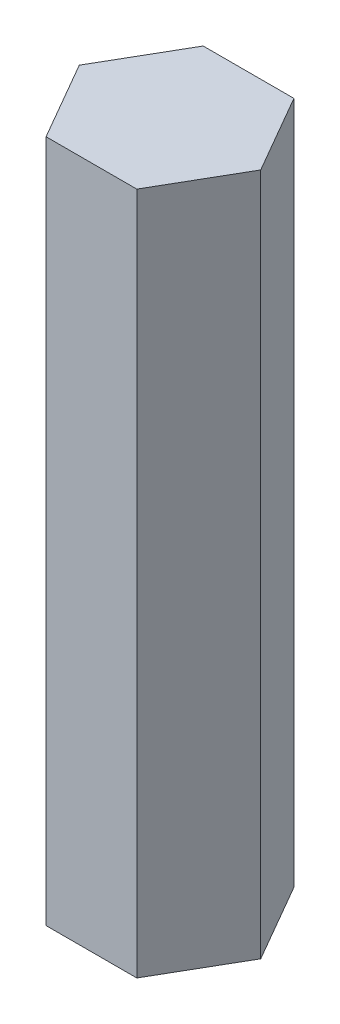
ISO-10303-21;
HEADER;
FILE_DESCRIPTION(('STEP AP214'),'2;1');
FILE_NAME('part.step','',(''),(''),'','','');
FILE_SCHEMA(('AUTOMOTIVE_DESIGN { 1 0 10303 214 1 1 1 1 }'));
ENDSEC;
DATA;
#1=APPLICATION_CONTEXT('core data for automotive mechanical design processes');
#2=APPLICATION_PROTOCOL_DEFINITION('international standard','automotive_design',2000,#1);
#3=PRODUCT_CONTEXT('',#1,'mechanical');
#4=PRODUCT('Part','Part','',(#3));
#5=PRODUCT_RELATED_PRODUCT_CATEGORY('part','',(#4));
#6=PRODUCT_DEFINITION_FORMATION('','',#4);
#7=PRODUCT_DEFINITION_CONTEXT('part definition',#1,'design');
#8=PRODUCT_DEFINITION('design','',#6,#7);
#9=PRODUCT_DEFINITION_SHAPE('','',#8);
#10=(LENGTH_UNIT() NAMED_UNIT(*) SI_UNIT(.MILLI.,.METRE.));
#11=(NAMED_UNIT(*) PLANE_ANGLE_UNIT() SI_UNIT($,.RADIAN.));
#12=(NAMED_UNIT(*) SI_UNIT($,.STERADIAN.) SOLID_ANGLE_UNIT());
#13=UNCERTAINTY_MEASURE_WITH_UNIT(LENGTH_MEASURE(1.E-05),#10,'distance_accuracy_value','');
#14=(GEOMETRIC_REPRESENTATION_CONTEXT(3) GLOBAL_UNCERTAINTY_ASSIGNED_CONTEXT((#13)) GLOBAL_UNIT_ASSIGNED_CONTEXT((#10,
#11,#12)) REPRESENTATION_CONTEXT('',''));
#15=CARTESIAN_POINT('',(0.,0.,0.));
#16=DIRECTION('',(0.,0.,1.));
#17=DIRECTION('',(1.,0.,0.));
#18=AXIS2_PLACEMENT_3D('',#15,#16,#17);
#19=CARTESIAN_POINT('',(-1.65994818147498,25.,2.874961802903));
#20=DIRECTION('',(2.30114762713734E-05,0.,-0.999999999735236));
#21=DIRECTION('',(-0.999999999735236,0.,-2.30114762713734E-05));
#22=AXIS2_PLACEMENT_3D('',#19,#20,#21);
#23=PLANE('',#22);
#24=DIRECTION('',(0.999999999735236,0.,2.30114762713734E-05));
#25=VECTOR('',#24,1.);
#26=CARTESIAN_POINT('',(-1.65994818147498,0.,2.874961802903));
#27=LINE('',#26,#25);
#28=CARTESIAN_POINT('',(-1.65994818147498,0.,2.874961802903));
#29=VERTEX_POINT('',#28);
#30=CARTESIAN_POINT('',(1.65981586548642,0.,2.87503819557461));
#31=VERTEX_POINT('',#30);
#32=EDGE_CURVE('E119',#29,#31,#27,.T.);
#33=ORIENTED_EDGE('',*,*,#32,.T.);
#34=DIRECTION('',(0.,-1.,0.));
#35=VECTOR('',#34,1.);
#36=CARTESIAN_POINT('',(1.65981586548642,25.,2.87503819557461));
#37=LINE('',#36,#35);
#38=CARTESIAN_POINT('',(1.65981586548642,25.,2.87503819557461));
#39=VERTEX_POINT('',#38);
#40=EDGE_CURVE('E11',#39,#31,#37,.T.);
#41=ORIENTED_EDGE('',*,*,#40,.F.);
#42=DIRECTION('',(0.999999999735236,0.,2.30114762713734E-05));
#43=VECTOR('',#42,1.);
#44=CARTESIAN_POINT('',(-1.65994818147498,25.,2.874961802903));
#45=LINE('',#44,#43);
#46=CARTESIAN_POINT('',(-1.65994818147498,25.,2.874961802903));
#47=VERTEX_POINT('',#46);
#48=EDGE_CURVE('E129',#47,#39,#45,.T.);
#49=ORIENTED_EDGE('',*,*,#48,.F.);
#50=DIRECTION('',(0.,-1.,0.));
#51=VECTOR('',#50,1.);
#52=CARTESIAN_POINT('',(-1.65994818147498,25.,2.874961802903));
#53=LINE('',#52,#51);
#54=EDGE_CURVE('E115',#47,#29,#53,.T.);
#55=ORIENTED_EDGE('',*,*,#54,.T.);
#56=EDGE_LOOP('',(#33,#41,#49,#55));
#57=FACE_BOUND('',#56,.T.);
#58=ADVANCED_FACE('F35',(#57),#23,.F.);
#59=CARTESIAN_POINT('',(1.65981586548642,25.,2.87503819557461));
#60=DIRECTION('',(-0.866013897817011,0.,-0.500019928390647));
#61=DIRECTION('',(-0.500019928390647,0.,0.866013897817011));
#62=AXIS2_PLACEMENT_3D('',#59,#60,#61);
#63=PLANE('',#62);
#64=DIRECTION('',(0.500019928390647,0.,-0.866013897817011));
#65=VECTOR('',#64,1.);
#66=CARTESIAN_POINT('',(1.65981586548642,0.,2.87503819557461));
#67=LINE('',#66,#65);
#68=CARTESIAN_POINT('',(3.31976404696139,0.,7.63926716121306E-05));
#69=VERTEX_POINT('',#68);
#70=EDGE_CURVE('E122',#31,#69,#67,.T.);
#71=ORIENTED_EDGE('',*,*,#70,.T.);
#72=DIRECTION('',(0.,-1.,0.));
#73=VECTOR('',#72,1.);
#74=CARTESIAN_POINT('',(3.31976404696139,25.,7.63926716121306E-05));
#75=LINE('',#74,#73);
#76=CARTESIAN_POINT('',(3.31976404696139,25.,7.63926716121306E-05));
#77=VERTEX_POINT('',#76);
#78=EDGE_CURVE('E43',#77,#69,#75,.T.);
#79=ORIENTED_EDGE('',*,*,#78,.F.);
#80=DIRECTION('',(0.500019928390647,0.,-0.866013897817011));
#81=VECTOR('',#80,1.);
#82=CARTESIAN_POINT('',(1.65981586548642,25.,2.87503819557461));
#83=LINE('',#82,#81);
#84=EDGE_CURVE('E88',#39,#77,#83,.T.);
#85=ORIENTED_EDGE('',*,*,#84,.F.);
#86=ORIENTED_EDGE('',*,*,#40,.T.);
#87=EDGE_LOOP('',(#71,#79,#85,#86));
#88=FACE_BOUND('',#87,.T.);
#89=ADVANCED_FACE('F153',(#88),#63,.F.);
#90=CARTESIAN_POINT('',(3.31976404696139,25.,7.63926716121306E-05));
#91=DIRECTION('',(-0.866036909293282,0.,0.499980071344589));
#92=DIRECTION('',(0.499980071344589,0.,0.866036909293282));
#93=AXIS2_PLACEMENT_3D('',#90,#91,#92);
#94=PLANE('',#93);
#95=DIRECTION('',(-0.499980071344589,0.,-0.866036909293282));
#96=VECTOR('',#95,1.);
#97=CARTESIAN_POINT('',(3.31976404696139,0.,7.63926716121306E-05));
#98=LINE('',#97,#96);
#99=CARTESIAN_POINT('',(1.65994818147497,0.,-2.874961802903));
#100=VERTEX_POINT('',#99);
#101=EDGE_CURVE('E124',#69,#100,#98,.T.);
#102=ORIENTED_EDGE('',*,*,#101,.T.);
#103=DIRECTION('',(0.,-1.,0.));
#104=VECTOR('',#103,1.);
#105=CARTESIAN_POINT('',(1.65994818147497,25.,-2.874961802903));
#106=LINE('',#105,#104);
#107=CARTESIAN_POINT('',(1.65994818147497,25.,-2.874961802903));
#108=VERTEX_POINT('',#107);
#109=EDGE_CURVE('E110',#108,#100,#106,.T.);
#110=ORIENTED_EDGE('',*,*,#109,.F.);
#111=DIRECTION('',(-0.499980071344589,0.,-0.866036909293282));
#112=VECTOR('',#111,1.);
#113=CARTESIAN_POINT('',(3.31976404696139,25.,7.63926716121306E-05));
#114=LINE('',#113,#112);
#115=EDGE_CURVE('E101',#77,#108,#114,.T.);
#116=ORIENTED_EDGE('',*,*,#115,.F.);
#117=ORIENTED_EDGE('',*,*,#78,.T.);
#118=EDGE_LOOP('',(#102,#110,#116,#117));
#119=FACE_BOUND('',#118,.T.);
#120=ADVANCED_FACE('F135',(#119),#94,.F.);
#121=CARTESIAN_POINT('',(1.65994818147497,25.,-2.874961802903));
#122=DIRECTION('',(-2.30114762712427E-05,0.,0.999999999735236));
#123=DIRECTION('',(0.999999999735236,0.,2.30114762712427E-05));
#124=AXIS2_PLACEMENT_3D('',#121,#122,#123);
#125=PLANE('',#124);
#126=DIRECTION('',(-0.999999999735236,0.,-2.30114762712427E-05));
#127=VECTOR('',#126,1.);
#128=CARTESIAN_POINT('',(1.65994818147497,0.,-2.874961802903));
#129=LINE('',#128,#127);
#130=CARTESIAN_POINT('',(-1.65981586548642,0.,-2.87503819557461));
#131=VERTEX_POINT('',#130);
#132=EDGE_CURVE('E109',#100,#131,#129,.T.);
#133=ORIENTED_EDGE('',*,*,#132,.T.);
#134=DIRECTION('',(0.,-1.,0.));
#135=VECTOR('',#134,1.);
#136=CARTESIAN_POINT('',(-1.65981586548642,25.,-2.87503819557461));
#137=LINE('',#136,#135);
#138=CARTESIAN_POINT('',(-1.65981586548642,25.,-2.87503819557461));
#139=VERTEX_POINT('',#138);
#140=EDGE_CURVE('E106',#139,#131,#137,.T.);
#141=ORIENTED_EDGE('',*,*,#140,.F.);
#142=DIRECTION('',(-0.999999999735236,0.,-2.30114762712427E-05));
#143=VECTOR('',#142,1.);
#144=CARTESIAN_POINT('',(1.65994818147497,25.,-2.874961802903));
#145=LINE('',#144,#143);
#146=EDGE_CURVE('E95',#108,#139,#145,.T.);
#147=ORIENTED_EDGE('',*,*,#146,.F.);
#148=ORIENTED_EDGE('',*,*,#109,.T.);
#149=EDGE_LOOP('',(#133,#141,#147,#148));
#150=FACE_BOUND('',#149,.T.);
#151=ADVANCED_FACE('F107',(#150),#125,.F.);
#152=CARTESIAN_POINT('',(-1.65981586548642,25.,-2.87503819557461));
#153=DIRECTION('',(0.866013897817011,0.,0.500019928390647));
#154=DIRECTION('',(0.500019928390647,0.,-0.866013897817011));
#155=AXIS2_PLACEMENT_3D('',#152,#153,#154);
#156=PLANE('',#155);
#157=DIRECTION('',(-0.500019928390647,0.,0.866013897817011));
#158=VECTOR('',#157,1.);
#159=CARTESIAN_POINT('',(-1.65981586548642,0.,-2.87503819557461));
#160=LINE('',#159,#158);
#161=CARTESIAN_POINT('',(-3.31976404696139,0.,-7.63926716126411E-05));
#162=VERTEX_POINT('',#161);
#163=EDGE_CURVE('E74',#131,#162,#160,.T.);
#164=ORIENTED_EDGE('',*,*,#163,.T.);
#165=DIRECTION('',(0.,-1.,0.));
#166=VECTOR('',#165,1.);
#167=CARTESIAN_POINT('',(-3.31976404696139,25.,-7.63926716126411E-05));
#168=LINE('',#167,#166);
#169=CARTESIAN_POINT('',(-3.31976404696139,25.,-7.63926716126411E-05));
#170=VERTEX_POINT('',#169);
#171=EDGE_CURVE('E111',#170,#162,#168,.T.);
#172=ORIENTED_EDGE('',*,*,#171,.F.);
#173=DIRECTION('',(-0.500019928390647,0.,0.866013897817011));
#174=VECTOR('',#173,1.);
#175=CARTESIAN_POINT('',(-1.65981586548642,25.,-2.87503819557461));
#176=LINE('',#175,#174);
#177=EDGE_CURVE('E99',#139,#170,#176,.T.);
#178=ORIENTED_EDGE('',*,*,#177,.F.);
#179=ORIENTED_EDGE('',*,*,#140,.T.);
#180=EDGE_LOOP('',(#164,#172,#178,#179));
#181=FACE_BOUND('',#180,.T.);
#182=ADVANCED_FACE('F113',(#181),#156,.F.);
#183=CARTESIAN_POINT('',(-3.31976404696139,25.,-7.63926716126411E-05));
#184=DIRECTION('',(0.866036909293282,0.,-0.499980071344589));
#185=DIRECTION('',(-0.499980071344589,0.,-0.866036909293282));
#186=AXIS2_PLACEMENT_3D('',#183,#184,#185);
#187=PLANE('',#186);
#188=DIRECTION('',(0.499980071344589,0.,0.866036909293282));
#189=VECTOR('',#188,1.);
#190=CARTESIAN_POINT('',(-3.31976404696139,0.,-7.63926716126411E-05));
#191=LINE('',#190,#189);
#192=EDGE_CURVE('E80',#162,#29,#191,.T.);
#193=ORIENTED_EDGE('',*,*,#192,.T.);
#194=ORIENTED_EDGE('',*,*,#54,.F.);
#195=DIRECTION('',(0.499980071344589,0.,0.866036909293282));
#196=VECTOR('',#195,1.);
#197=CARTESIAN_POINT('',(-3.31976404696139,25.,-7.63926716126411E-05));
#198=LINE('',#197,#196);
#199=EDGE_CURVE('E51',#170,#47,#198,.T.);
#200=ORIENTED_EDGE('',*,*,#199,.F.);
#201=ORIENTED_EDGE('',*,*,#171,.T.);
#202=EDGE_LOOP('',(#193,#194,#200,#201));
#203=FACE_BOUND('',#202,.T.);
#204=ADVANCED_FACE('F142',(#203),#187,.F.);
#205=CARTESIAN_POINT('',(0.,25.,0.));
#206=DIRECTION('',(0.,1.,0.));
#207=DIRECTION('',(0.,0.,1.));
#208=AXIS2_PLACEMENT_3D('',#205,#206,#207);
#209=PLANE('',#208);
#210=ORIENTED_EDGE('',*,*,#48,.T.);
#211=ORIENTED_EDGE('',*,*,#84,.T.);
#212=ORIENTED_EDGE('',*,*,#115,.T.);
#213=ORIENTED_EDGE('',*,*,#146,.T.);
#214=ORIENTED_EDGE('',*,*,#177,.T.);
#215=ORIENTED_EDGE('',*,*,#199,.T.);
#216=EDGE_LOOP('',(#210,#211,#212,#213,#214,#215));
#217=FACE_BOUND('',#216,.T.);
#218=ADVANCED_FACE('F97',(#217),#209,.T.);
#219=CARTESIAN_POINT('',(0.,0.,0.));
#220=DIRECTION('',(0.,1.,0.));
#221=DIRECTION('',(0.,0.,1.));
#222=AXIS2_PLACEMENT_3D('',#219,#220,#221);
#223=PLANE('',#222);
#224=ORIENTED_EDGE('',*,*,#32,.F.);
#225=ORIENTED_EDGE('',*,*,#192,.F.);
#226=ORIENTED_EDGE('',*,*,#163,.F.);
#227=ORIENTED_EDGE('',*,*,#132,.F.);
#228=ORIENTED_EDGE('',*,*,#101,.F.);
#229=ORIENTED_EDGE('',*,*,#70,.F.);
#230=EDGE_LOOP('',(#224,#225,#226,#227,#228,#229));
#231=FACE_BOUND('',#230,.T.);
#232=ADVANCED_FACE('F138',(#231),#223,.F.);
#233=CLOSED_SHELL('',(#58,#89,#120,#151,#182,#204,#218,#232));
#234=MANIFOLD_SOLID_BREP('B2',#233);
#235=ADVANCED_BREP_SHAPE_REPRESENTATION('',(#18,#234),#14);
#236=SHAPE_DEFINITION_REPRESENTATION(#9,#235);
ENDSEC;
END-ISO-10303-21;
